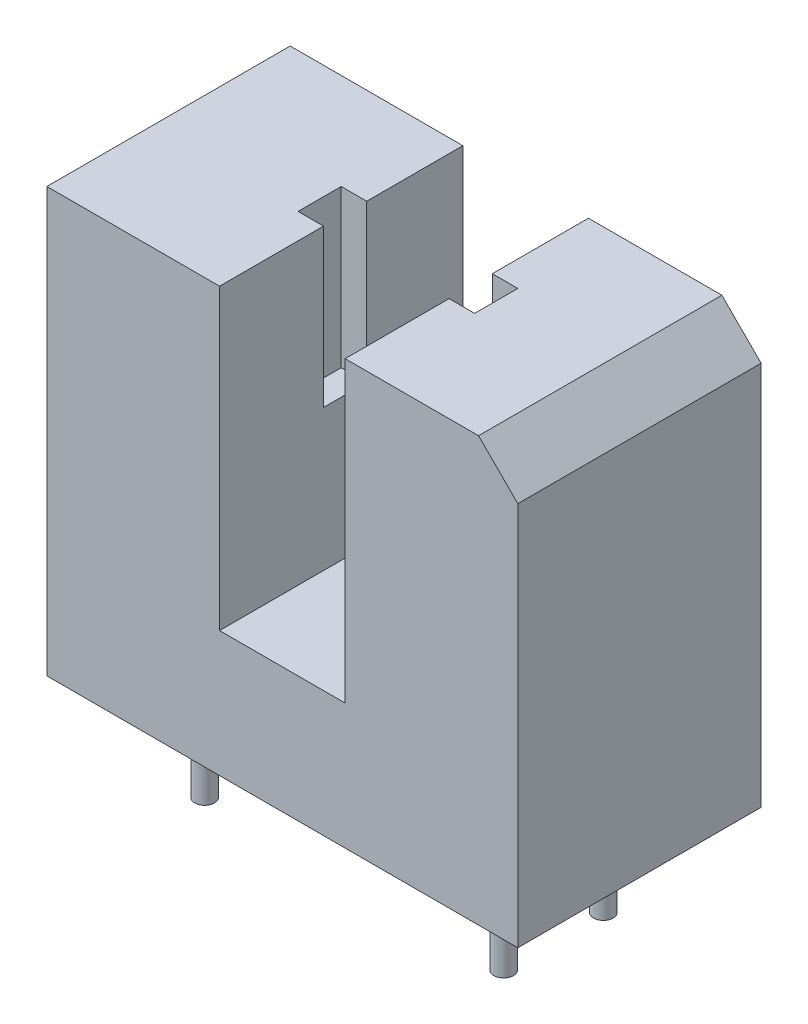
ISO-10303-21;
HEADER;
FILE_DESCRIPTION(('STEP AP214'),'2;1');
FILE_NAME('part.step','',(''),(''),'','','');
FILE_SCHEMA(('AUTOMOTIVE_DESIGN { 1 0 10303 214 1 1 1 1 }'));
ENDSEC;
DATA;
#1=APPLICATION_CONTEXT('core data for automotive mechanical design processes');
#2=APPLICATION_PROTOCOL_DEFINITION('international standard','automotive_design',2000,#1);
#3=PRODUCT_CONTEXT('',#1,'mechanical');
#4=PRODUCT('Part','Part','',(#3));
#5=PRODUCT_RELATED_PRODUCT_CATEGORY('part','',(#4));
#6=PRODUCT_DEFINITION_FORMATION('','',#4);
#7=PRODUCT_DEFINITION_CONTEXT('part definition',#1,'design');
#8=PRODUCT_DEFINITION('design','',#6,#7);
#9=PRODUCT_DEFINITION_SHAPE('','',#8);
#10=(LENGTH_UNIT() NAMED_UNIT(*) SI_UNIT(.MILLI.,.METRE.));
#11=(NAMED_UNIT(*) PLANE_ANGLE_UNIT() SI_UNIT($,.RADIAN.));
#12=(NAMED_UNIT(*) SI_UNIT($,.STERADIAN.) SOLID_ANGLE_UNIT());
#13=UNCERTAINTY_MEASURE_WITH_UNIT(LENGTH_MEASURE(1.E-05),#10,'distance_accuracy_value','');
#14=(GEOMETRIC_REPRESENTATION_CONTEXT(3) GLOBAL_UNCERTAINTY_ASSIGNED_CONTEXT((#13)) GLOBAL_UNIT_ASSIGNED_CONTEXT((#10,
#11,#12)) REPRESENTATION_CONTEXT('',''));
#15=CARTESIAN_POINT('',(0.,0.,0.));
#16=DIRECTION('',(0.,0.,1.));
#17=DIRECTION('',(1.,0.,0.));
#18=AXIS2_PLACEMENT_3D('',#15,#16,#17);
#19=CARTESIAN_POINT('',(-5.99999999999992,-2.49999999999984,0.));
#20=DIRECTION('',(0.,-1.,0.));
#21=DIRECTION('',(1.,0.,0.));
#22=AXIS2_PLACEMENT_3D('',#19,#20,#21);
#23=PLANE('',#22);
#24=CARTESIAN_POINT('',(-3.81000000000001,-2.49999999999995,1.83));
#25=DIRECTION('',(0.,-1.,0.));
#26=DIRECTION('',(1.,0.,0.));
#27=AXIS2_PLACEMENT_3D('',#24,#25,#26);
#28=CIRCLE('',#27,0.25);
#29=CARTESIAN_POINT('',(-3.56000000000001,-2.49999999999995,1.83));
#30=VERTEX_POINT('',#29);
#31=EDGE_CURVE('E19',#30,#30,#28,.F.);
#32=ORIENTED_EDGE('',*,*,#31,.F.);
#33=EDGE_LOOP('',(#32));
#34=FACE_BOUND('',#33,.T.);
#35=ADVANCED_FACE('F16',(#34),#23,.T.);
#36=CARTESIAN_POINT('',(-5.99999999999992,-2.49999999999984,0.));
#37=DIRECTION('',(0.,-1.,0.));
#38=DIRECTION('',(1.,0.,0.));
#39=AXIS2_PLACEMENT_3D('',#36,#37,#38);
#40=PLANE('',#39);
#41=CARTESIAN_POINT('',(3.81000000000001,-2.49999999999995,1.83));
#42=DIRECTION('',(0.,-1.,0.));
#43=DIRECTION('',(1.,0.,0.));
#44=AXIS2_PLACEMENT_3D('',#41,#42,#43);
#45=CIRCLE('',#44,0.25);
#46=CARTESIAN_POINT('',(4.06000000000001,-2.49999999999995,1.83));
#47=VERTEX_POINT('',#46);
#48=EDGE_CURVE('E186',#47,#47,#45,.F.);
#49=ORIENTED_EDGE('',*,*,#48,.F.);
#50=EDGE_LOOP('',(#49));
#51=FACE_BOUND('',#50,.T.);
#52=ADVANCED_FACE('F197',(#51),#40,.T.);
#53=CARTESIAN_POINT('',(-5.99999999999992,-2.49999999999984,0.));
#54=DIRECTION('',(0.,-1.,0.));
#55=DIRECTION('',(1.,0.,0.));
#56=AXIS2_PLACEMENT_3D('',#53,#54,#55);
#57=PLANE('',#56);
#58=CARTESIAN_POINT('',(3.81000000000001,-2.49999999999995,4.37000000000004));
#59=DIRECTION('',(0.,-1.,0.));
#60=DIRECTION('',(1.,0.,0.));
#61=AXIS2_PLACEMENT_3D('',#58,#59,#60);
#62=CIRCLE('',#61,0.25);
#63=CARTESIAN_POINT('',(4.06000000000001,-2.49999999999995,4.37000000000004));
#64=VERTEX_POINT('',#63);
#65=EDGE_CURVE('E184',#64,#64,#62,.F.);
#66=ORIENTED_EDGE('',*,*,#65,.F.);
#67=EDGE_LOOP('',(#66));
#68=FACE_BOUND('',#67,.T.);
#69=ADVANCED_FACE('F202',(#68),#57,.T.);
#70=CARTESIAN_POINT('',(-5.99999999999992,-2.49999999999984,0.));
#71=DIRECTION('',(0.,-1.,0.));
#72=DIRECTION('',(1.,0.,0.));
#73=AXIS2_PLACEMENT_3D('',#70,#71,#72);
#74=PLANE('',#73);
#75=CARTESIAN_POINT('',(-3.81000000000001,-2.49999999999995,4.37000000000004));
#76=DIRECTION('',(0.,-1.,0.));
#77=DIRECTION('',(1.,0.,0.));
#78=AXIS2_PLACEMENT_3D('',#75,#76,#77);
#79=CIRCLE('',#78,0.25);
#80=CARTESIAN_POINT('',(-3.56000000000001,-2.49999999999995,4.37000000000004));
#81=VERTEX_POINT('',#80);
#82=EDGE_CURVE('E163',#81,#81,#79,.F.);
#83=ORIENTED_EDGE('',*,*,#82,.F.);
#84=EDGE_LOOP('',(#83));
#85=FACE_BOUND('',#84,.T.);
#86=ADVANCED_FACE('F289',(#85),#74,.T.);
#87=CARTESIAN_POINT('',(2.25,11.3000000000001,2.45000000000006));
#88=DIRECTION('',(1.,0.,0.));
#89=DIRECTION('',(0.,1.,0.));
#90=AXIS2_PLACEMENT_3D('',#87,#88,#89);
#91=PLANE('',#90);
#92=DIRECTION('',(0.,1.,0.));
#93=VECTOR('',#92,1.);
#94=CARTESIAN_POINT('',(2.25,0.,3.55));
#95=LINE('',#94,#93);
#96=CARTESIAN_POINT('',(2.25,10.8000000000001,3.55000000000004));
#97=VERTEX_POINT('',#96);
#98=CARTESIAN_POINT('',(2.25,6.80000000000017,3.55000000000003));
#99=VERTEX_POINT('',#98);
#100=EDGE_CURVE('E132',#97,#99,#95,.F.);
#101=ORIENTED_EDGE('',*,*,#100,.F.);
#102=DIRECTION('',(0.,0.,1.));
#103=VECTOR('',#102,1.);
#104=CARTESIAN_POINT('',(2.25,10.8000000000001,2.45000000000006));
#105=LINE('',#104,#103);
#106=CARTESIAN_POINT('',(2.25,10.8000000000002,2.45000000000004));
#107=VERTEX_POINT('',#106);
#108=EDGE_CURVE('E158',#107,#97,#105,.T.);
#109=ORIENTED_EDGE('',*,*,#108,.F.);
#110=DIRECTION('',(0.,1.,0.));
#111=VECTOR('',#110,1.);
#112=CARTESIAN_POINT('',(2.25,1.66533453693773E-13,2.44999999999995));
#113=LINE('',#112,#111);
#114=CARTESIAN_POINT('',(2.25,6.80000000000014,2.45000000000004));
#115=VERTEX_POINT('',#114);
#116=EDGE_CURVE('E147',#107,#115,#113,.F.);
#117=ORIENTED_EDGE('',*,*,#116,.T.);
#118=DIRECTION('',(0.,0.,1.));
#119=VECTOR('',#118,1.);
#120=CARTESIAN_POINT('',(2.25,6.80000000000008,2.45000000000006));
#121=LINE('',#120,#119);
#122=EDGE_CURVE('E138',#115,#99,#121,.T.);
#123=ORIENTED_EDGE('',*,*,#122,.T.);
#124=EDGE_LOOP('',(#101,#109,#117,#123));
#125=FACE_BOUND('',#124,.T.);
#126=ADVANCED_FACE('F157',(#125),#91,.F.);
#127=CARTESIAN_POINT('',(-2.25,6.80000000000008,2.45000000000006));
#128=DIRECTION('',(-1.,0.,0.));
#129=DIRECTION('',(0.,-1.,0.));
#130=AXIS2_PLACEMENT_3D('',#127,#128,#129);
#131=PLANE('',#130);
#132=DIRECTION('',(0.,1.,0.));
#133=VECTOR('',#132,1.);
#134=CARTESIAN_POINT('',(-2.25,1.66533453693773E-13,2.44999999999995));
#135=LINE('',#134,#133);
#136=CARTESIAN_POINT('',(-2.25,6.80000000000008,2.45000000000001));
#137=VERTEX_POINT('',#136);
#138=CARTESIAN_POINT('',(-2.25,10.8000000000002,2.45000000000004));
#139=VERTEX_POINT('',#138);
#140=EDGE_CURVE('E480',#137,#139,#135,.T.);
#141=ORIENTED_EDGE('',*,*,#140,.T.);
#142=DIRECTION('',(0.,0.,1.));
#143=VECTOR('',#142,1.);
#144=CARTESIAN_POINT('',(-2.25,10.8000000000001,2.45000000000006));
#145=LINE('',#144,#143);
#146=CARTESIAN_POINT('',(-2.25,10.8000000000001,3.55000000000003));
#147=VERTEX_POINT('',#146);
#148=EDGE_CURVE('E164',#147,#139,#145,.F.);
#149=ORIENTED_EDGE('',*,*,#148,.F.);
#150=DIRECTION('',(0.,1.,0.));
#151=VECTOR('',#150,1.);
#152=CARTESIAN_POINT('',(-2.25,0.,3.55));
#153=LINE('',#152,#151);
#154=CARTESIAN_POINT('',(-2.25,6.80000000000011,3.55));
#155=VERTEX_POINT('',#154);
#156=EDGE_CURVE('E526',#155,#147,#153,.T.);
#157=ORIENTED_EDGE('',*,*,#156,.F.);
#158=DIRECTION('',(0.,0.,1.));
#159=VECTOR('',#158,1.);
#160=CARTESIAN_POINT('',(-2.25,6.80000000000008,2.45000000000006));
#161=LINE('',#160,#159);
#162=EDGE_CURVE('E483',#155,#137,#161,.F.);
#163=ORIENTED_EDGE('',*,*,#162,.T.);
#164=EDGE_LOOP('',(#141,#149,#157,#163));
#165=FACE_BOUND('',#164,.T.);
#166=ADVANCED_FACE('F283',(#165),#131,.F.);
#167=CARTESIAN_POINT('',(-3.81000000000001,1.11022302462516E-13,1.83));
#168=DIRECTION('',(0.,-1.,0.));
#169=DIRECTION('',(1.,0.,0.));
#170=AXIS2_PLACEMENT_3D('',#167,#168,#169);
#171=CYLINDRICAL_SURFACE('',#170,0.25);
#172=ORIENTED_EDGE('',*,*,#31,.T.);
#173=EDGE_LOOP('',(#172));
#174=FACE_BOUND('',#173,.T.);
#175=CARTESIAN_POINT('',(-3.81000000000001,1.11022302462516E-13,1.83));
#176=DIRECTION('',(0.,-1.,0.));
#177=DIRECTION('',(1.,0.,0.));
#178=AXIS2_PLACEMENT_3D('',#175,#176,#177);
#179=CIRCLE('',#178,0.25);
#180=CARTESIAN_POINT('',(-3.56000000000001,1.11022302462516E-13,1.83));
#181=VERTEX_POINT('',#180);
#182=EDGE_CURVE('E178',#181,#181,#179,.F.);
#183=ORIENTED_EDGE('',*,*,#182,.F.);
#184=EDGE_LOOP('',(#183));
#185=FACE_BOUND('',#184,.T.);
#186=ADVANCED_FACE('F193',(#174,#185),#171,.T.);
#187=CARTESIAN_POINT('',(3.81000000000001,1.11022302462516E-13,1.83));
#188=DIRECTION('',(0.,-1.,0.));
#189=DIRECTION('',(1.,0.,0.));
#190=AXIS2_PLACEMENT_3D('',#187,#188,#189);
#191=CYLINDRICAL_SURFACE('',#190,0.25);
#192=ORIENTED_EDGE('',*,*,#48,.T.);
#193=EDGE_LOOP('',(#192));
#194=FACE_BOUND('',#193,.T.);
#195=CARTESIAN_POINT('',(3.81000000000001,1.11022302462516E-13,1.83));
#196=DIRECTION('',(0.,-1.,0.));
#197=DIRECTION('',(1.,0.,0.));
#198=AXIS2_PLACEMENT_3D('',#195,#196,#197);
#199=CIRCLE('',#198,0.25);
#200=CARTESIAN_POINT('',(4.06000000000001,1.11022302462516E-13,1.83));
#201=VERTEX_POINT('',#200);
#202=EDGE_CURVE('E175',#201,#201,#199,.F.);
#203=ORIENTED_EDGE('',*,*,#202,.F.);
#204=EDGE_LOOP('',(#203));
#205=FACE_BOUND('',#204,.T.);
#206=ADVANCED_FACE('F277',(#194,#205),#191,.T.);
#207=CARTESIAN_POINT('',(3.81000000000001,0.,4.37000000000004));
#208=DIRECTION('',(0.,-1.,0.));
#209=DIRECTION('',(1.,0.,0.));
#210=AXIS2_PLACEMENT_3D('',#207,#208,#209);
#211=CYLINDRICAL_SURFACE('',#210,0.25);
#212=ORIENTED_EDGE('',*,*,#65,.T.);
#213=EDGE_LOOP('',(#212));
#214=FACE_BOUND('',#213,.T.);
#215=CARTESIAN_POINT('',(3.81000000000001,0.,4.37000000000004));
#216=DIRECTION('',(0.,-1.,0.));
#217=DIRECTION('',(1.,0.,0.));
#218=AXIS2_PLACEMENT_3D('',#215,#216,#217);
#219=CIRCLE('',#218,0.25);
#220=CARTESIAN_POINT('',(4.06000000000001,0.,4.37000000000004));
#221=VERTEX_POINT('',#220);
#222=EDGE_CURVE('E172',#221,#221,#219,.F.);
#223=ORIENTED_EDGE('',*,*,#222,.F.);
#224=EDGE_LOOP('',(#223));
#225=FACE_BOUND('',#224,.T.);
#226=ADVANCED_FACE('F273',(#214,#225),#211,.T.);
#227=CARTESIAN_POINT('',(-3.81000000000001,0.,4.37000000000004));
#228=DIRECTION('',(0.,-1.,0.));
#229=DIRECTION('',(1.,0.,0.));
#230=AXIS2_PLACEMENT_3D('',#227,#228,#229);
#231=CYLINDRICAL_SURFACE('',#230,0.25);
#232=ORIENTED_EDGE('',*,*,#82,.T.);
#233=EDGE_LOOP('',(#232));
#234=FACE_BOUND('',#233,.T.);
#235=CARTESIAN_POINT('',(-3.81000000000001,0.,4.37000000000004));
#236=DIRECTION('',(0.,-1.,0.));
#237=DIRECTION('',(1.,0.,0.));
#238=AXIS2_PLACEMENT_3D('',#235,#236,#237);
#239=CIRCLE('',#238,0.25);
#240=CARTESIAN_POINT('',(-3.56000000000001,0.,4.37000000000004));
#241=VERTEX_POINT('',#240);
#242=EDGE_CURVE('E168',#241,#241,#239,.F.);
#243=ORIENTED_EDGE('',*,*,#242,.F.);
#244=EDGE_LOOP('',(#243));
#245=FACE_BOUND('',#244,.T.);
#246=ADVANCED_FACE('F269',(#234,#245),#231,.T.);
#247=CARTESIAN_POINT('',(5.,10.8000000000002,0.));
#248=DIRECTION('',(0.707106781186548,0.707106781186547,0.));
#249=DIRECTION('',(-0.707106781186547,0.707106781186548,0.));
#250=AXIS2_PLACEMENT_3D('',#247,#248,#249);
#251=PLANE('',#250);
#252=DIRECTION('',(-0.707106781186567,0.707106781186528,0.));
#253=VECTOR('',#252,1.);
#254=CARTESIAN_POINT('',(6.00000000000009,9.80000000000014,6.19999999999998));
#255=LINE('',#254,#253);
#256=CARTESIAN_POINT('',(6.00000000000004,9.80000000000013,6.19999999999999));
#257=VERTEX_POINT('',#256);
#258=CARTESIAN_POINT('',(5.00000000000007,10.8000000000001,6.19999999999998));
#259=VERTEX_POINT('',#258);
#260=EDGE_CURVE('E181',#257,#259,#255,.T.);
#261=ORIENTED_EDGE('',*,*,#260,.F.);
#262=DIRECTION('',(0.,0.,1.));
#263=VECTOR('',#262,1.);
#264=CARTESIAN_POINT('',(6.00000000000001,9.80000000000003,0.));
#265=LINE('',#264,#263);
#266=CARTESIAN_POINT('',(6.00000000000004,9.80000000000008,0.));
#267=VERTEX_POINT('',#266);
#268=EDGE_CURVE('E520',#267,#257,#265,.T.);
#269=ORIENTED_EDGE('',*,*,#268,.F.);
#270=DIRECTION('',(-0.707106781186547,0.707106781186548,0.));
#271=VECTOR('',#270,1.);
#272=CARTESIAN_POINT('',(5.,10.8000000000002,0.));
#273=LINE('',#272,#271);
#274=CARTESIAN_POINT('',(5.00000000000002,10.8000000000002,0.));
#275=VERTEX_POINT('',#274);
#276=EDGE_CURVE('E148',#267,#275,#273,.T.);
#277=ORIENTED_EDGE('',*,*,#276,.T.);
#278=DIRECTION('',(0.,0.,1.));
#279=VECTOR('',#278,1.);
#280=CARTESIAN_POINT('',(5.00000000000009,10.8000000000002,0.));
#281=LINE('',#280,#279);
#282=EDGE_CURVE('E502',#259,#275,#281,.F.);
#283=ORIENTED_EDGE('',*,*,#282,.F.);
#284=EDGE_LOOP('',(#261,#269,#277,#283));
#285=FACE_BOUND('',#284,.T.);
#286=ADVANCED_FACE('F266',(#285),#251,.T.);
#287=CARTESIAN_POINT('',(2.25,6.80000000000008,2.45000000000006));
#288=DIRECTION('',(0.,-1.,0.));
#289=DIRECTION('',(1.,0.,0.));
#290=AXIS2_PLACEMENT_3D('',#287,#288,#289);
#291=PLANE('',#290);
#292=DIRECTION('',(-1.,0.,0.));
#293=VECTOR('',#292,1.);
#294=CARTESIAN_POINT('',(0.,6.80000000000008,2.44999999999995));
#295=LINE('',#294,#293);
#296=CARTESIAN_POINT('',(1.59999999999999,6.80000000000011,2.45000000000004));
#297=VERTEX_POINT('',#296);
#298=EDGE_CURVE('E142',#115,#297,#295,.T.);
#299=ORIENTED_EDGE('',*,*,#298,.T.);
#300=DIRECTION('',(0.,0.,1.));
#301=VECTOR('',#300,1.);
#302=CARTESIAN_POINT('',(1.59999999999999,6.80000000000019,0.));
#303=LINE('',#302,#301);
#304=CARTESIAN_POINT('',(1.59999999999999,6.80000000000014,3.55000000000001));
#305=VERTEX_POINT('',#304);
#306=EDGE_CURVE('E497',#305,#297,#303,.F.);
#307=ORIENTED_EDGE('',*,*,#306,.F.);
#308=DIRECTION('',(-1.,0.,0.));
#309=VECTOR('',#308,1.);
#310=CARTESIAN_POINT('',(0.,6.80000000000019,3.55));
#311=LINE('',#310,#309);
#312=EDGE_CURVE('E144',#99,#305,#311,.T.);
#313=ORIENTED_EDGE('',*,*,#312,.F.);
#314=ORIENTED_EDGE('',*,*,#122,.F.);
#315=EDGE_LOOP('',(#299,#307,#313,#314));
#316=FACE_BOUND('',#315,.T.);
#317=ADVANCED_FACE('F140',(#316),#291,.F.);
#318=CARTESIAN_POINT('',(0.,1.66533453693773E-13,2.44999999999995));
#319=DIRECTION('',(0.,0.,-1.));
#320=DIRECTION('',(-1.,0.,0.));
#321=AXIS2_PLACEMENT_3D('',#318,#319,#320);
#322=PLANE('',#321);
#323=ORIENTED_EDGE('',*,*,#116,.F.);
#324=DIRECTION('',(-1.,0.,0.));
#325=VECTOR('',#324,1.);
#326=CARTESIAN_POINT('',(6.00000000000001,10.8000000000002,2.45000000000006));
#327=LINE('',#326,#325);
#328=CARTESIAN_POINT('',(1.59999999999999,10.8000000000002,2.45000000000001));
#329=VERTEX_POINT('',#328);
#330=EDGE_CURVE('E515',#329,#107,#327,.F.);
#331=ORIENTED_EDGE('',*,*,#330,.F.);
#332=DIRECTION('',(0.,-1.,0.));
#333=VECTOR('',#332,1.);
#334=CARTESIAN_POINT('',(1.59999999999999,10.8000000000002,2.45000000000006));
#335=LINE('',#334,#333);
#336=EDGE_CURVE('E155',#297,#329,#335,.F.);
#337=ORIENTED_EDGE('',*,*,#336,.F.);
#338=ORIENTED_EDGE('',*,*,#298,.F.);
#339=EDGE_LOOP('',(#323,#331,#337,#338));
#340=FACE_BOUND('',#339,.T.);
#341=ADVANCED_FACE('F152',(#340),#322,.F.);
#342=CARTESIAN_POINT('',(0.,0.,3.55));
#343=DIRECTION('',(0.,0.,-1.));
#344=DIRECTION('',(-1.,0.,0.));
#345=AXIS2_PLACEMENT_3D('',#342,#343,#344);
#346=PLANE('',#345);
#347=ORIENTED_EDGE('',*,*,#100,.T.);
#348=ORIENTED_EDGE('',*,*,#312,.T.);
#349=DIRECTION('',(0.,-1.,0.));
#350=VECTOR('',#349,1.);
#351=CARTESIAN_POINT('',(1.59999999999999,10.8000000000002,3.55000000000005));
#352=LINE('',#351,#350);
#353=CARTESIAN_POINT('',(1.59999999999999,10.8000000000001,3.55000000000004));
#354=VERTEX_POINT('',#353);
#355=EDGE_CURVE('E495',#354,#305,#352,.T.);
#356=ORIENTED_EDGE('',*,*,#355,.F.);
#357=DIRECTION('',(-1.,0.,0.));
#358=VECTOR('',#357,1.);
#359=CARTESIAN_POINT('',(6.00000000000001,10.8000000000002,3.55000000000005));
#360=LINE('',#359,#358);
#361=EDGE_CURVE('E513',#97,#354,#360,.T.);
#362=ORIENTED_EDGE('',*,*,#361,.F.);
#363=EDGE_LOOP('',(#347,#348,#356,#362));
#364=FACE_BOUND('',#363,.T.);
#365=ADVANCED_FACE('F258',(#364),#346,.T.);
#366=CARTESIAN_POINT('',(0.,1.66533453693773E-13,2.44999999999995));
#367=DIRECTION('',(0.,0.,-1.));
#368=DIRECTION('',(-1.,0.,0.));
#369=AXIS2_PLACEMENT_3D('',#366,#367,#368);
#370=PLANE('',#369);
#371=DIRECTION('',(1.,0.,0.));
#372=VECTOR('',#371,1.);
#373=CARTESIAN_POINT('',(2.25,6.80000000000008,2.45000000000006));
#374=LINE('',#373,#372);
#375=CARTESIAN_POINT('',(-1.59999999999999,6.80000000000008,2.45000000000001));
#376=VERTEX_POINT('',#375);
#377=EDGE_CURVE('E486',#137,#376,#374,.T.);
#378=ORIENTED_EDGE('',*,*,#377,.T.);
#379=DIRECTION('',(0.,1.,0.));
#380=VECTOR('',#379,1.);
#381=CARTESIAN_POINT('',(-1.59999999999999,3.20000000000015,2.45000000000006));
#382=LINE('',#381,#380);
#383=CARTESIAN_POINT('',(-1.59999999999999,10.8000000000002,2.45000000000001));
#384=VERTEX_POINT('',#383);
#385=EDGE_CURVE('E558',#384,#376,#382,.F.);
#386=ORIENTED_EDGE('',*,*,#385,.F.);
#387=DIRECTION('',(-1.,0.,0.));
#388=VECTOR('',#387,1.);
#389=CARTESIAN_POINT('',(0.,10.8000000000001,2.44999999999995));
#390=LINE('',#389,#388);
#391=EDGE_CURVE('E487',#139,#384,#390,.F.);
#392=ORIENTED_EDGE('',*,*,#391,.F.);
#393=ORIENTED_EDGE('',*,*,#140,.F.);
#394=EDGE_LOOP('',(#378,#386,#392,#393));
#395=FACE_BOUND('',#394,.T.);
#396=ADVANCED_FACE('F254',(#395),#370,.F.);
#397=CARTESIAN_POINT('',(2.25,6.80000000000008,2.45000000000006));
#398=DIRECTION('',(0.,-1.,0.));
#399=DIRECTION('',(1.,0.,0.));
#400=AXIS2_PLACEMENT_3D('',#397,#398,#399);
#401=PLANE('',#400);
#402=DIRECTION('',(-1.,0.,0.));
#403=VECTOR('',#402,1.);
#404=CARTESIAN_POINT('',(0.,6.80000000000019,3.55));
#405=LINE('',#404,#403);
#406=CARTESIAN_POINT('',(-1.59999999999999,6.80000000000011,3.55));
#407=VERTEX_POINT('',#406);
#408=EDGE_CURVE('E528',#407,#155,#405,.T.);
#409=ORIENTED_EDGE('',*,*,#408,.F.);
#410=DIRECTION('',(0.,0.,1.));
#411=VECTOR('',#410,1.);
#412=CARTESIAN_POINT('',(-1.59999999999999,6.80000000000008,0.));
#413=LINE('',#412,#411);
#414=EDGE_CURVE('E540',#376,#407,#413,.T.);
#415=ORIENTED_EDGE('',*,*,#414,.F.);
#416=ORIENTED_EDGE('',*,*,#377,.F.);
#417=ORIENTED_EDGE('',*,*,#162,.F.);
#418=EDGE_LOOP('',(#409,#415,#416,#417));
#419=FACE_BOUND('',#418,.T.);
#420=ADVANCED_FACE('F250',(#419),#401,.F.);
#421=CARTESIAN_POINT('',(0.,0.,3.55));
#422=DIRECTION('',(0.,0.,-1.));
#423=DIRECTION('',(-1.,0.,0.));
#424=AXIS2_PLACEMENT_3D('',#421,#422,#423);
#425=PLANE('',#424);
#426=ORIENTED_EDGE('',*,*,#408,.T.);
#427=ORIENTED_EDGE('',*,*,#156,.T.);
#428=DIRECTION('',(-1.,0.,0.));
#429=VECTOR('',#428,1.);
#430=CARTESIAN_POINT('',(0.,10.8000000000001,3.55));
#431=LINE('',#430,#429);
#432=CARTESIAN_POINT('',(-1.59999999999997,10.8000000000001,3.55000000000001));
#433=VERTEX_POINT('',#432);
#434=EDGE_CURVE('E531',#147,#433,#431,.F.);
#435=ORIENTED_EDGE('',*,*,#434,.T.);
#436=DIRECTION('',(0.,1.,0.));
#437=VECTOR('',#436,1.);
#438=CARTESIAN_POINT('',(-1.59999999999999,3.20000000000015,3.55));
#439=LINE('',#438,#437);
#440=EDGE_CURVE('E535',#407,#433,#439,.T.);
#441=ORIENTED_EDGE('',*,*,#440,.F.);
#442=EDGE_LOOP('',(#426,#427,#435,#441));
#443=FACE_BOUND('',#442,.T.);
#444=ADVANCED_FACE('F246',(#443),#425,.T.);
#445=CARTESIAN_POINT('',(0.,0.,6.19999999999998));
#446=DIRECTION('',(0.,0.,1.));
#447=DIRECTION('',(1.,0.,0.));
#448=AXIS2_PLACEMENT_3D('',#445,#446,#447);
#449=PLANE('',#448);
#450=DIRECTION('',(-1.,0.,0.));
#451=VECTOR('',#450,1.);
#452=CARTESIAN_POINT('',(-1.59999999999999,10.8000000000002,6.19999999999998));
#453=LINE('',#452,#451);
#454=CARTESIAN_POINT('',(-5.99999999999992,10.8000000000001,6.19999999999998));
#455=VERTEX_POINT('',#454);
#456=CARTESIAN_POINT('',(-1.59999999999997,10.8000000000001,6.19999999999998));
#457=VERTEX_POINT('',#456);
#458=EDGE_CURVE('E544',#455,#457,#453,.F.);
#459=ORIENTED_EDGE('',*,*,#458,.F.);
#460=DIRECTION('',(0.,-1.,0.));
#461=VECTOR('',#460,1.);
#462=CARTESIAN_POINT('',(-5.99999999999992,10.8000000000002,6.19999999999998));
#463=LINE('',#462,#461);
#464=CARTESIAN_POINT('',(-5.99999999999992,0.,6.19999999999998));
#465=VERTEX_POINT('',#464);
#466=EDGE_CURVE('E589',#465,#455,#463,.F.);
#467=ORIENTED_EDGE('',*,*,#466,.F.);
#468=DIRECTION('',(1.,0.,0.));
#469=VECTOR('',#468,1.);
#470=CARTESIAN_POINT('',(-5.99999999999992,0.,6.19999999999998));
#471=LINE('',#470,#469);
#472=CARTESIAN_POINT('',(6.00000000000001,0.,6.19999999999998));
#473=VERTEX_POINT('',#472);
#474=EDGE_CURVE('E171',#473,#465,#471,.F.);
#475=ORIENTED_EDGE('',*,*,#474,.F.);
#476=DIRECTION('',(0.,1.,0.));
#477=VECTOR('',#476,1.);
#478=CARTESIAN_POINT('',(6.00000000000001,0.,6.19999999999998));
#479=LINE('',#478,#477);
#480=EDGE_CURVE('E517',#257,#473,#479,.F.);
#481=ORIENTED_EDGE('',*,*,#480,.F.);
#482=ORIENTED_EDGE('',*,*,#260,.T.);
#483=DIRECTION('',(-1.,0.,0.));
#484=VECTOR('',#483,1.);
#485=CARTESIAN_POINT('',(6.00000000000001,10.8000000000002,6.19999999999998));
#486=LINE('',#485,#484);
#487=CARTESIAN_POINT('',(1.60000000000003,10.8000000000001,6.19999999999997));
#488=VERTEX_POINT('',#487);
#489=EDGE_CURVE('E507',#488,#259,#486,.F.);
#490=ORIENTED_EDGE('',*,*,#489,.F.);
#491=DIRECTION('',(0.,-1.,0.));
#492=VECTOR('',#491,1.);
#493=CARTESIAN_POINT('',(1.59999999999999,10.8000000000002,6.19999999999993));
#494=LINE('',#493,#492);
#495=CARTESIAN_POINT('',(1.60000000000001,3.20000000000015,6.19999999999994));
#496=VERTEX_POINT('',#495);
#497=EDGE_CURVE('E565',#496,#488,#494,.F.);
#498=ORIENTED_EDGE('',*,*,#497,.F.);
#499=DIRECTION('',(-1.,0.,0.));
#500=VECTOR('',#499,1.);
#501=CARTESIAN_POINT('',(1.59999999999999,3.20000000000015,6.19999999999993));
#502=LINE('',#501,#500);
#503=CARTESIAN_POINT('',(-1.59999999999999,3.20000000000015,6.19999999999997));
#504=VERTEX_POINT('',#503);
#505=EDGE_CURVE('E560',#504,#496,#502,.F.);
#506=ORIENTED_EDGE('',*,*,#505,.F.);
#507=DIRECTION('',(0.,1.,0.));
#508=VECTOR('',#507,1.);
#509=CARTESIAN_POINT('',(-1.59999999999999,3.20000000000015,6.19999999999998));
#510=LINE('',#509,#508);
#511=EDGE_CURVE('E542',#457,#504,#510,.F.);
#512=ORIENTED_EDGE('',*,*,#511,.F.);
#513=EDGE_LOOP('',(#459,#467,#475,#481,#482,#490,#498,#506,#512));
#514=FACE_BOUND('',#513,.T.);
#515=ADVANCED_FACE('F242',(#514),#449,.T.);
#516=CARTESIAN_POINT('',(-5.99999999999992,0.,0.));
#517=DIRECTION('',(0.,-1.,0.));
#518=DIRECTION('',(1.,0.,0.));
#519=AXIS2_PLACEMENT_3D('',#516,#517,#518);
#520=PLANE('',#519);
#521=DIRECTION('',(0.,0.,1.));
#522=VECTOR('',#521,1.);
#523=CARTESIAN_POINT('',(6.00000000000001,0.,0.));
#524=LINE('',#523,#522);
#525=CARTESIAN_POINT('',(6.00000000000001,0.,0.));
#526=VERTEX_POINT('',#525);
#527=EDGE_CURVE('E522',#473,#526,#524,.F.);
#528=ORIENTED_EDGE('',*,*,#527,.F.);
#529=ORIENTED_EDGE('',*,*,#474,.T.);
#530=DIRECTION('',(0.,0.,1.));
#531=VECTOR('',#530,1.);
#532=CARTESIAN_POINT('',(-5.99999999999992,0.,0.));
#533=LINE('',#532,#531);
#534=CARTESIAN_POINT('',(-5.99999999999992,0.,0.));
#535=VERTEX_POINT('',#534);
#536=EDGE_CURVE('E547',#535,#465,#533,.T.);
#537=ORIENTED_EDGE('',*,*,#536,.F.);
#538=DIRECTION('',(1.,0.,0.));
#539=VECTOR('',#538,1.);
#540=CARTESIAN_POINT('',(0.,0.,0.));
#541=LINE('',#540,#539);
#542=EDGE_CURVE('E583',#535,#526,#541,.T.);
#543=ORIENTED_EDGE('',*,*,#542,.T.);
#544=EDGE_LOOP('',(#528,#529,#537,#543));
#545=FACE_BOUND('',#544,.T.);
#546=ORIENTED_EDGE('',*,*,#242,.T.);
#547=EDGE_LOOP('',(#546));
#548=FACE_BOUND('',#547,.T.);
#549=ORIENTED_EDGE('',*,*,#222,.T.);
#550=EDGE_LOOP('',(#549));
#551=FACE_BOUND('',#550,.T.);
#552=ORIENTED_EDGE('',*,*,#202,.T.);
#553=EDGE_LOOP('',(#552));
#554=FACE_BOUND('',#553,.T.);
#555=ORIENTED_EDGE('',*,*,#182,.T.);
#556=EDGE_LOOP('',(#555));
#557=FACE_BOUND('',#556,.T.);
#558=ADVANCED_FACE('F238',(#545,#548,#551,#554,#557),#520,.T.);
#559=CARTESIAN_POINT('',(6.00000000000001,0.,0.));
#560=DIRECTION('',(1.,0.,0.));
#561=DIRECTION('',(0.,1.,0.));
#562=AXIS2_PLACEMENT_3D('',#559,#560,#561);
#563=PLANE('',#562);
#564=ORIENTED_EDGE('',*,*,#268,.T.);
#565=ORIENTED_EDGE('',*,*,#480,.T.);
#566=ORIENTED_EDGE('',*,*,#527,.T.);
#567=DIRECTION('',(0.,1.,0.));
#568=VECTOR('',#567,1.);
#569=CARTESIAN_POINT('',(6.00000000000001,0.,0.));
#570=LINE('',#569,#568);
#571=EDGE_CURVE('E580',#526,#267,#570,.T.);
#572=ORIENTED_EDGE('',*,*,#571,.T.);
#573=EDGE_LOOP('',(#564,#565,#566,#572));
#574=FACE_BOUND('',#573,.T.);
#575=ADVANCED_FACE('F234',(#574),#563,.T.);
#576=CARTESIAN_POINT('',(6.00000000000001,10.8000000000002,0.));
#577=DIRECTION('',(0.,1.,0.));
#578=DIRECTION('',(-1.,0.,0.));
#579=AXIS2_PLACEMENT_3D('',#576,#577,#578);
#580=PLANE('',#579);
#581=ORIENTED_EDGE('',*,*,#282,.T.);
#582=DIRECTION('',(1.,0.,0.));
#583=VECTOR('',#582,1.);
#584=CARTESIAN_POINT('',(0.,10.8000000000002,0.));
#585=LINE('',#584,#583);
#586=CARTESIAN_POINT('',(1.59999999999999,10.8000000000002,0.));
#587=VERTEX_POINT('',#586);
#588=EDGE_CURVE('E574',#275,#587,#585,.F.);
#589=ORIENTED_EDGE('',*,*,#588,.T.);
#590=DIRECTION('',(0.,0.,1.));
#591=VECTOR('',#590,1.);
#592=CARTESIAN_POINT('',(1.59999999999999,10.8000000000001,0.));
#593=LINE('',#592,#591);
#594=EDGE_CURVE('E504',#329,#587,#593,.F.);
#595=ORIENTED_EDGE('',*,*,#594,.F.);
#596=ORIENTED_EDGE('',*,*,#330,.T.);
#597=ORIENTED_EDGE('',*,*,#108,.T.);
#598=ORIENTED_EDGE('',*,*,#361,.T.);
#599=DIRECTION('',(0.,0.,1.));
#600=VECTOR('',#599,1.);
#601=CARTESIAN_POINT('',(1.59999999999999,10.8000000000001,0.));
#602=LINE('',#601,#600);
#603=EDGE_CURVE('E499',#488,#354,#602,.F.);
#604=ORIENTED_EDGE('',*,*,#603,.F.);
#605=ORIENTED_EDGE('',*,*,#489,.T.);
#606=EDGE_LOOP('',(#581,#589,#595,#596,#597,#598,#604,#605));
#607=FACE_BOUND('',#606,.T.);
#608=ADVANCED_FACE('F230',(#607),#580,.T.);
#609=CARTESIAN_POINT('',(1.59999999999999,10.8000000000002,0.));
#610=DIRECTION('',(-1.,0.,0.));
#611=DIRECTION('',(0.,-1.,0.));
#612=AXIS2_PLACEMENT_3D('',#609,#610,#611);
#613=PLANE('',#612);
#614=ORIENTED_EDGE('',*,*,#603,.T.);
#615=ORIENTED_EDGE('',*,*,#355,.T.);
#616=ORIENTED_EDGE('',*,*,#306,.T.);
#617=ORIENTED_EDGE('',*,*,#336,.T.);
#618=ORIENTED_EDGE('',*,*,#594,.T.);
#619=DIRECTION('',(0.,1.,0.));
#620=VECTOR('',#619,1.);
#621=CARTESIAN_POINT('',(1.59999999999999,0.,0.));
#622=LINE('',#621,#620);
#623=CARTESIAN_POINT('',(1.59999999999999,3.20000000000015,0.));
#624=VERTEX_POINT('',#623);
#625=EDGE_CURVE('E570',#587,#624,#622,.F.);
#626=ORIENTED_EDGE('',*,*,#625,.T.);
#627=DIRECTION('',(0.,0.,1.));
#628=VECTOR('',#627,1.);
#629=CARTESIAN_POINT('',(1.59999999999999,3.20000000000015,0.));
#630=LINE('',#629,#628);
#631=EDGE_CURVE('E500',#496,#624,#630,.F.);
#632=ORIENTED_EDGE('',*,*,#631,.F.);
#633=ORIENTED_EDGE('',*,*,#497,.T.);
#634=EDGE_LOOP('',(#614,#615,#616,#617,#618,#626,#632,#633));
#635=FACE_BOUND('',#634,.T.);
#636=ADVANCED_FACE('F226',(#635),#613,.T.);
#637=CARTESIAN_POINT('',(1.59999999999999,3.20000000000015,0.));
#638=DIRECTION('',(0.,1.,0.));
#639=DIRECTION('',(-1.,0.,0.));
#640=AXIS2_PLACEMENT_3D('',#637,#638,#639);
#641=PLANE('',#640);
#642=DIRECTION('',(0.,0.,1.));
#643=VECTOR('',#642,1.);
#644=CARTESIAN_POINT('',(-1.59999999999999,3.20000000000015,0.));
#645=LINE('',#644,#643);
#646=CARTESIAN_POINT('',(-1.59999999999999,3.20000000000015,0.));
#647=VERTEX_POINT('',#646);
#648=EDGE_CURVE('E554',#504,#647,#645,.F.);
#649=ORIENTED_EDGE('',*,*,#648,.F.);
#650=ORIENTED_EDGE('',*,*,#505,.T.);
#651=ORIENTED_EDGE('',*,*,#631,.T.);
#652=DIRECTION('',(1.,0.,0.));
#653=VECTOR('',#652,1.);
#654=CARTESIAN_POINT('',(0.,3.20000000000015,0.));
#655=LINE('',#654,#653);
#656=EDGE_CURVE('E577',#624,#647,#655,.F.);
#657=ORIENTED_EDGE('',*,*,#656,.T.);
#658=EDGE_LOOP('',(#649,#650,#651,#657));
#659=FACE_BOUND('',#658,.T.);
#660=ADVANCED_FACE('F222',(#659),#641,.T.);
#661=CARTESIAN_POINT('',(-1.59999999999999,3.20000000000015,0.));
#662=DIRECTION('',(1.,0.,0.));
#663=DIRECTION('',(0.,1.,0.));
#664=AXIS2_PLACEMENT_3D('',#661,#662,#663);
#665=PLANE('',#664);
#666=ORIENTED_EDGE('',*,*,#648,.T.);
#667=DIRECTION('',(0.,1.,0.));
#668=VECTOR('',#667,1.);
#669=CARTESIAN_POINT('',(-1.59999999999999,0.,0.));
#670=LINE('',#669,#668);
#671=CARTESIAN_POINT('',(-1.59999999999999,10.8000000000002,0.));
#672=VERTEX_POINT('',#671);
#673=EDGE_CURVE('E598',#647,#672,#670,.T.);
#674=ORIENTED_EDGE('',*,*,#673,.T.);
#675=DIRECTION('',(0.,0.,1.));
#676=VECTOR('',#675,1.);
#677=CARTESIAN_POINT('',(-1.59999999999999,10.8000000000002,0.));
#678=LINE('',#677,#676);
#679=EDGE_CURVE('E549',#384,#672,#678,.F.);
#680=ORIENTED_EDGE('',*,*,#679,.F.);
#681=ORIENTED_EDGE('',*,*,#385,.T.);
#682=ORIENTED_EDGE('',*,*,#414,.T.);
#683=ORIENTED_EDGE('',*,*,#440,.T.);
#684=DIRECTION('',(0.,0.,1.));
#685=VECTOR('',#684,1.);
#686=CARTESIAN_POINT('',(-1.59999999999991,10.8000000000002,0.));
#687=LINE('',#686,#685);
#688=EDGE_CURVE('E538',#457,#433,#687,.F.);
#689=ORIENTED_EDGE('',*,*,#688,.F.);
#690=ORIENTED_EDGE('',*,*,#511,.T.);
#691=EDGE_LOOP('',(#666,#674,#680,#681,#682,#683,#689,#690));
#692=FACE_BOUND('',#691,.T.);
#693=ADVANCED_FACE('F218',(#692),#665,.T.);
#694=CARTESIAN_POINT('',(-1.59999999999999,10.8000000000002,0.));
#695=DIRECTION('',(0.,1.,0.));
#696=DIRECTION('',(-1.,0.,0.));
#697=AXIS2_PLACEMENT_3D('',#694,#695,#696);
#698=PLANE('',#697);
#699=ORIENTED_EDGE('',*,*,#688,.T.);
#700=ORIENTED_EDGE('',*,*,#434,.F.);
#701=ORIENTED_EDGE('',*,*,#148,.T.);
#702=ORIENTED_EDGE('',*,*,#391,.T.);
#703=ORIENTED_EDGE('',*,*,#679,.T.);
#704=DIRECTION('',(1.,0.,0.));
#705=VECTOR('',#704,1.);
#706=CARTESIAN_POINT('',(0.,10.8000000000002,0.));
#707=LINE('',#706,#705);
#708=CARTESIAN_POINT('',(-5.99999999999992,10.8000000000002,0.));
#709=VERTEX_POINT('',#708);
#710=EDGE_CURVE('E25',#672,#709,#707,.F.);
#711=ORIENTED_EDGE('',*,*,#710,.T.);
#712=DIRECTION('',(0.,0.,1.));
#713=VECTOR('',#712,1.);
#714=CARTESIAN_POINT('',(-5.99999999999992,10.8000000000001,0.));
#715=LINE('',#714,#713);
#716=EDGE_CURVE('E33',#455,#709,#715,.F.);
#717=ORIENTED_EDGE('',*,*,#716,.F.);
#718=ORIENTED_EDGE('',*,*,#458,.T.);
#719=EDGE_LOOP('',(#699,#700,#701,#702,#703,#711,#717,#718));
#720=FACE_BOUND('',#719,.T.);
#721=ADVANCED_FACE('F212',(#720),#698,.T.);
#722=CARTESIAN_POINT('',(-5.99999999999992,10.8000000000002,0.));
#723=DIRECTION('',(-1.,0.,0.));
#724=DIRECTION('',(0.,-1.,0.));
#725=AXIS2_PLACEMENT_3D('',#722,#723,#724);
#726=PLANE('',#725);
#727=ORIENTED_EDGE('',*,*,#536,.T.);
#728=ORIENTED_EDGE('',*,*,#466,.T.);
#729=ORIENTED_EDGE('',*,*,#716,.T.);
#730=DIRECTION('',(0.,1.,0.));
#731=VECTOR('',#730,1.);
#732=CARTESIAN_POINT('',(-5.99999999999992,0.,0.));
#733=LINE('',#732,#731);
#734=EDGE_CURVE('E11',#709,#535,#733,.F.);
#735=ORIENTED_EDGE('',*,*,#734,.T.);
#736=EDGE_LOOP('',(#727,#728,#729,#735));
#737=FACE_BOUND('',#736,.T.);
#738=ADVANCED_FACE('F206',(#737),#726,.T.);
#739=CARTESIAN_POINT('',(0.,0.,0.));
#740=DIRECTION('',(0.,0.,1.));
#741=DIRECTION('',(1.,0.,0.));
#742=AXIS2_PLACEMENT_3D('',#739,#740,#741);
#743=PLANE('',#742);
#744=ORIENTED_EDGE('',*,*,#710,.F.);
#745=ORIENTED_EDGE('',*,*,#673,.F.);
#746=ORIENTED_EDGE('',*,*,#656,.F.);
#747=ORIENTED_EDGE('',*,*,#625,.F.);
#748=ORIENTED_EDGE('',*,*,#588,.F.);
#749=ORIENTED_EDGE('',*,*,#276,.F.);
#750=ORIENTED_EDGE('',*,*,#571,.F.);
#751=ORIENTED_EDGE('',*,*,#542,.F.);
#752=ORIENTED_EDGE('',*,*,#734,.F.);
#753=EDGE_LOOP('',(#744,#745,#746,#747,#748,#749,#750,#751,#752));
#754=FACE_BOUND('',#753,.T.);
#755=ADVANCED_FACE('F204',(#754),#743,.F.);
#756=CLOSED_SHELL('',(#35,#52,#69,#86,#126,#166,#186,#206,#226,#246,#286,#317,#341,#365,#396,
#420,#444,#515,#558,#575,#608,#636,#660,#693,#721,#738,#755));
#757=MANIFOLD_SOLID_BREP('B1',#756);
#758=ADVANCED_BREP_SHAPE_REPRESENTATION('',(#18,#757),#14);
#759=SHAPE_DEFINITION_REPRESENTATION(#9,#758);
ENDSEC;
END-ISO-10303-21;
